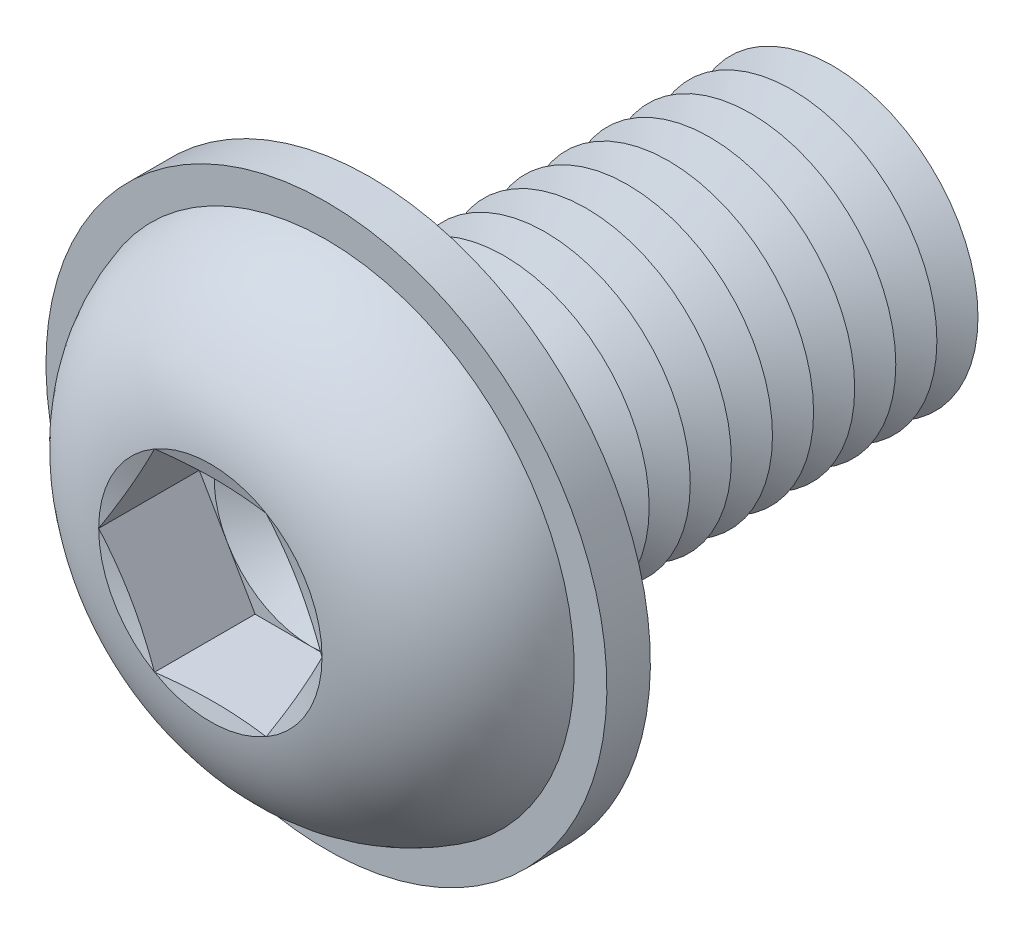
from build123d import *

# Parameters (mm, degrees)
FILLET1_R           = 0.85
LPATTERN1_COUNT     = 11
LPATTERN1_PITCH     = 1.7
CUT_EXTRUDE1_DEPTH  = 4.16
SKETCH5_R           = 11.6
SKETCH5_R_2         = 6.85
BOSS_EXTRUDE1_DEPTH = 1.8


with BuildPart() as part:
    # Sketch1 → Revolve1 (revolve)
    with BuildSketch(Plane(origin=(0, 0, 0), x_dir=(0, 0, -1), z_dir=(1, 0, 0))):
        with BuildLine():
            Line((0, 6), (0, 10.5))
            ThreePointArc((0, 10.5), (-4.420082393, 8.816378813), (-6.6, 4.6188))
            Line((-6.6, 4.6188), (-5.981198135, 2.3094))
            Line((-5.981198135, 2.3094), (-6.6, 2.3094))
            Line((-6.6, 2.3094), (-6.6, 0))
            Line((-6.6, 0), (20, 0))
            Line((20, 0), (20, 6))
            Line((20, 6), (0, 6))
        make_face()
    revolve(axis=Axis((0, 0, -20), (0, 0, 1)))

    # Fillet1
    fillet1_edges = [part.edges().sort_by_distance(p)[0] for p in [
        (0, -6, 0),
    ]]
    fillet(fillet1_edges, radius=FILLET1_R)

    # Sketch2 → Cut-Revolve1 (revolve, cut)
    with BuildSketch(Plane(origin=(0, 0, 0), x_dir=(0, 0, -1), z_dir=(1, 0, 0))):
        Polygon((19.15, 6), (20.85, 6), (20, 4.527756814), align=None)
    cut_revolve1 = revolve(axis=Axis((0, 0, -20), (0, 0, -1)), mode=Mode.SUBTRACT)

    # LPattern1: Cut-Revolve1 ×11
    with Locations(*[(0, 0, i * LPATTERN1_PITCH) for i in range(1, LPATTERN1_COUNT)]):
        add(cut_revolve1, mode=Mode.SUBTRACT)

    # Sketch3 → Cut-Extrude1 (cut)
    with BuildSketch(Plane.XY.offset(6.6)):
        Polygon((2.3094, 3.999998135), (-2.3094, 3.999998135), (-4.6188, 0), (-2.3094, -3.999998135), (2.3094, -3.999998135), (4.6188, 0), align=None)
    extrude(amount=-CUT_EXTRUDE1_DEPTH, mode=Mode.SUBTRACT)

    # Cut-Extrude2 cone 1 section (on through the dimple's axis) → Cut-Extrude2 (revolve, cut)
    with BuildSketch(Plane(origin=(0, 0, 2.44), x_dir=(0, -1, 0), z_dir=(1, 0, 0))):
        Polygon((0, 0), (3.999998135, 0), (0, 2.3094), align=None)
    revolve(axis=Axis((0, 0, 2.44), (0, 0, -1)), mode=Mode.SUBTRACT)

    # Sketch5 → Boss-Extrude1 (add)
    with BuildSketch(Plane(origin=(0, 0, 0), x_dir=(-1, 0, 0), z_dir=(0, 0, -1))):
        with Locations(Location((0, 0, 0), (0, 0, 90))):
            Circle(SKETCH5_R)
        Circle(SKETCH5_R_2, mode=Mode.SUBTRACT)
    extrude(amount=-BOSS_EXTRUDE1_DEPTH)


solid = part.part
